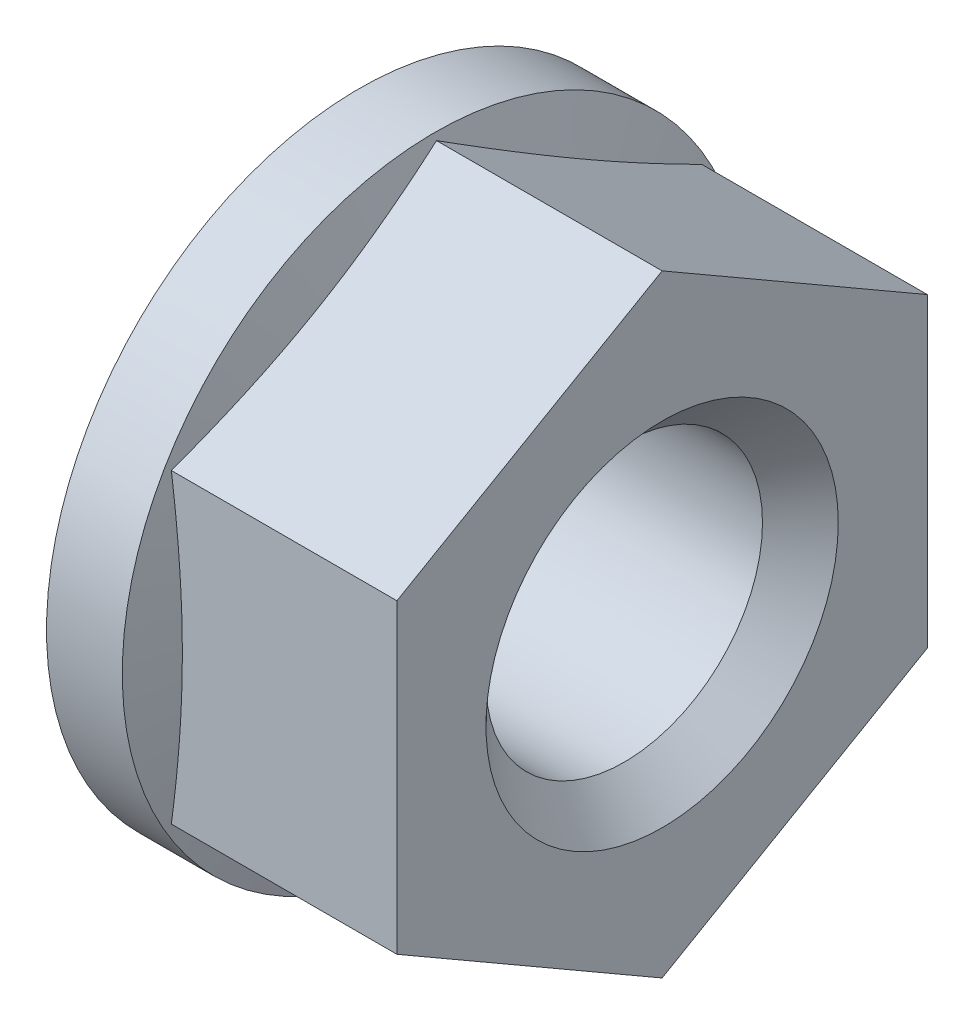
ISO-10303-21;
HEADER;
FILE_DESCRIPTION(('STEP AP214'),'2;1');
FILE_NAME('part.step','',(''),(''),'','','');
FILE_SCHEMA(('AUTOMOTIVE_DESIGN { 1 0 10303 214 1 1 1 1 }'));
ENDSEC;
DATA;
#1=APPLICATION_CONTEXT('core data for automotive mechanical design processes');
#2=APPLICATION_PROTOCOL_DEFINITION('international standard','automotive_design',2000,#1);
#3=PRODUCT_CONTEXT('',#1,'mechanical');
#4=PRODUCT('Part','Part','',(#3));
#5=PRODUCT_RELATED_PRODUCT_CATEGORY('part','',(#4));
#6=PRODUCT_DEFINITION_FORMATION('','',#4);
#7=PRODUCT_DEFINITION_CONTEXT('part definition',#1,'design');
#8=PRODUCT_DEFINITION('design','',#6,#7);
#9=PRODUCT_DEFINITION_SHAPE('','',#8);
#10=(LENGTH_UNIT() NAMED_UNIT(*) SI_UNIT(.MILLI.,.METRE.));
#11=(NAMED_UNIT(*) PLANE_ANGLE_UNIT() SI_UNIT($,.RADIAN.));
#12=(NAMED_UNIT(*) SI_UNIT($,.STERADIAN.) SOLID_ANGLE_UNIT());
#13=UNCERTAINTY_MEASURE_WITH_UNIT(LENGTH_MEASURE(1.E-05),#10,'distance_accuracy_value','');
#14=(GEOMETRIC_REPRESENTATION_CONTEXT(3) GLOBAL_UNCERTAINTY_ASSIGNED_CONTEXT((#13)) GLOBAL_UNIT_ASSIGNED_CONTEXT((#10,
#11,#12)) REPRESENTATION_CONTEXT('',''));
#15=CARTESIAN_POINT('',(0.,0.,0.));
#16=DIRECTION('',(0.,0.,1.));
#17=DIRECTION('',(1.,0.,0.));
#18=AXIS2_PLACEMENT_3D('',#15,#16,#17);
#19=CARTESIAN_POINT('',(0.,0.,0.));
#20=DIRECTION('',(1.,0.,0.));
#21=DIRECTION('',(0.,0.,-1.));
#22=AXIS2_PLACEMENT_3D('',#19,#20,#21);
#23=CYLINDRICAL_SURFACE('',#22,8.25);
#24=CARTESIAN_POINT('',(0.,0.,0.));
#25=DIRECTION('',(1.,0.,0.));
#26=DIRECTION('',(0.,0.,-1.));
#27=AXIS2_PLACEMENT_3D('',#24,#25,#26);
#28=CIRCLE('',#27,8.25);
#29=CARTESIAN_POINT('',(0.,0.,-8.25));
#30=VERTEX_POINT('',#29);
#31=EDGE_CURVE('E197',#30,#30,#28,.T.);
#32=ORIENTED_EDGE('',*,*,#31,.T.);
#33=EDGE_LOOP('',(#32));
#34=FACE_BOUND('',#33,.T.);
#35=CARTESIAN_POINT('',(2.,0.,0.));
#36=DIRECTION('',(1.,0.,0.));
#37=DIRECTION('',(0.,0.,-1.));
#38=AXIS2_PLACEMENT_3D('',#35,#36,#37);
#39=CIRCLE('',#38,8.25);
#40=CARTESIAN_POINT('',(2.,0.,-8.25));
#41=VERTEX_POINT('',#40);
#42=EDGE_CURVE('E194',#41,#41,#39,.T.);
#43=ORIENTED_EDGE('',*,*,#42,.F.);
#44=EDGE_LOOP('',(#43));
#45=FACE_BOUND('',#44,.T.);
#46=ADVANCED_FACE('F38',(#34,#45),#23,.T.);
#47=CARTESIAN_POINT('',(0.,8.25,0.));
#48=DIRECTION('',(-1.,0.,0.));
#49=DIRECTION('',(0.,0.,1.));
#50=AXIS2_PLACEMENT_3D('',#47,#48,#49);
#51=PLANE('',#50);
#52=CARTESIAN_POINT('',(0.,0.,0.));
#53=DIRECTION('',(-1.,0.,0.));
#54=DIRECTION('',(0.,0.,1.));
#55=AXIS2_PLACEMENT_3D('',#52,#53,#54);
#56=CIRCLE('',#55,3.64999999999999);
#57=CARTESIAN_POINT('',(0.,0.,3.64999999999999));
#58=VERTEX_POINT('',#57);
#59=EDGE_CURVE('E111',#58,#58,#56,.T.);
#60=ORIENTED_EDGE('',*,*,#59,.F.);
#61=EDGE_LOOP('',(#60));
#62=FACE_BOUND('',#61,.T.);
#63=ORIENTED_EDGE('',*,*,#31,.F.);
#64=EDGE_LOOP('',(#63));
#65=FACE_BOUND('',#64,.T.);
#66=ADVANCED_FACE('F213',(#62,#65),#51,.T.);
#67=CARTESIAN_POINT('',(4.21058083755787,0.,0.));
#68=DIRECTION('',(-1.,0.,0.));
#69=DIRECTION('',(0.,0.,1.));
#70=AXIS2_PLACEMENT_3D('',#67,#68,#69);
#71=CONICAL_SURFACE('',#70,0.,1.30899693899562);
#72=CARTESIAN_POINT('',(2.04477330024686,-4.04145188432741,7.00000000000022));
#73=CARTESIAN_POINT('',(2.08976059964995,-4.20928324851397,6.70930755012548));
#74=CARTESIAN_POINT('',(2.13060150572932,-4.37741889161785,6.41808807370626));
#75=CARTESIAN_POINT('',(2.20235498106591,-4.71428390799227,5.83462075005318));
#76=CARTESIAN_POINT('',(2.23326351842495,-4.883013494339,5.54237253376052));
#77=CARTESIAN_POINT('',(2.28334798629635,-5.22004348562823,4.95861946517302));
#78=CARTESIAN_POINT('',(2.30258363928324,-5.38834161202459,4.66711855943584));
#79=CARTESIAN_POINT('',(2.32837666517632,-5.72515246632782,4.08374504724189));
#80=CARTESIAN_POINT('',(2.33493649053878,-5.8936651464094,3.79187252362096));
#81=CARTESIAN_POINT('',(2.33493649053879,-6.23069050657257,3.20812747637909));
#82=CARTESIAN_POINT('',(2.32837666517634,-6.39920318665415,2.91625495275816));
#83=CARTESIAN_POINT('',(2.30258363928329,-6.73601404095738,2.33288144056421));
#84=CARTESIAN_POINT('',(2.2833479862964,-6.90431216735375,2.04138053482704));
#85=CARTESIAN_POINT('',(2.23326351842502,-7.24134215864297,1.45762746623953));
#86=CARTESIAN_POINT('',(2.20235498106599,-7.41007174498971,1.16537924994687));
#87=CARTESIAN_POINT('',(2.13060150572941,-7.74693676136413,0.581911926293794));
#88=CARTESIAN_POINT('',(2.08976059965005,-7.91507240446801,0.290692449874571));
#89=CARTESIAN_POINT('',(2.04477330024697,-8.08290376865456,-1.70279131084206E-13));
#90=B_SPLINE_CURVE_WITH_KNOTS('',3,(#72,#73,#74,#75,#76,#77,#78,#79,#80,#81,#82,#83,#84,#85,#86,
#87,#88,#89),.UNSPECIFIED.,.F.,.F.,(4,2,2,2,2,2,2,2,4),(0.,1.01604530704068,2.03250254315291,
3.04371439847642,4.05473058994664,5.06574678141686,6.07695863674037,7.0934158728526,
8.10946117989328),.UNSPECIFIED.);
#91=CARTESIAN_POINT('',(2.04477330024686,-4.04145188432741,7.00000000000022));
#92=VERTEX_POINT('',#91);
#93=CARTESIAN_POINT('',(2.04477330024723,-8.08290376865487,0.));
#94=VERTEX_POINT('',#93);
#95=EDGE_CURVE('E118',#92,#94,#90,.T.);
#96=ORIENTED_EDGE('',*,*,#95,.F.);
#97=CARTESIAN_POINT('',(2.04477330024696,4.04145188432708,7.));
#98=CARTESIAN_POINT('',(2.08976059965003,3.70578915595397,7.));
#99=CARTESIAN_POINT('',(2.13060150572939,3.36951786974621,7.));
#100=CARTESIAN_POINT('',(2.20235498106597,2.69578783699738,7.));
#101=CARTESIAN_POINT('',(2.23326351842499,2.35832866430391,7.));
#102=CARTESIAN_POINT('',(2.28334798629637,1.68426868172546,7.));
#103=CARTESIAN_POINT('',(2.30258363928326,1.34767242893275,7.));
#104=CARTESIAN_POINT('',(2.32837666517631,0.674050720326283,7.));
#105=CARTESIAN_POINT('',(2.33493649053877,0.337025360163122,7.));
#106=CARTESIAN_POINT('',(2.33493649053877,-0.337025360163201,7.));
#107=CARTESIAN_POINT('',(2.32837666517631,-0.674050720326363,7.));
#108=CARTESIAN_POINT('',(2.30258363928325,-1.34767242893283,7.));
#109=CARTESIAN_POINT('',(2.28334798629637,-1.68426868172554,7.));
#110=CARTESIAN_POINT('',(2.23326351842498,-2.35832866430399,7.));
#111=CARTESIAN_POINT('',(2.20235498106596,-2.69578783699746,7.));
#112=CARTESIAN_POINT('',(2.13060150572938,-3.36951786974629,7.));
#113=CARTESIAN_POINT('',(2.08976059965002,-3.70578915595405,7.));
#114=CARTESIAN_POINT('',(2.04477330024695,-4.04145188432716,7.));
#115=B_SPLINE_CURVE_WITH_KNOTS('',3,(#97,#98,#99,#100,#101,#102,#103,#104,#105,#106,#107,#108,
#109,#110,#111,#112,#113,#114),.UNSPECIFIED.,.F.,.F.,(4,2,2,2,2,2,2,2,4),(0.,1.01604530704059,
2.03250254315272,3.04371439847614,4.05473058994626,5.06574678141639,6.07695863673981,
7.09341587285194,8.10946117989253),.UNSPECIFIED.);
#116=CARTESIAN_POINT('',(2.04477330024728,4.04145188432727,7.));
#117=VERTEX_POINT('',#116);
#118=EDGE_CURVE('E100',#117,#92,#115,.T.);
#119=ORIENTED_EDGE('',*,*,#118,.F.);
#120=CARTESIAN_POINT('',(2.04477330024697,8.08290376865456,-1.70669287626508E-13));
#121=CARTESIAN_POINT('',(2.08976059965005,7.91507240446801,0.290692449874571));
#122=CARTESIAN_POINT('',(2.13060150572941,7.74693676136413,0.581911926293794));
#123=CARTESIAN_POINT('',(2.20235498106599,7.41007174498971,1.16537924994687));
#124=CARTESIAN_POINT('',(2.23326351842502,7.24134215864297,1.45762746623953));
#125=CARTESIAN_POINT('',(2.2833479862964,6.90431216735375,2.04138053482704));
#126=CARTESIAN_POINT('',(2.30258363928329,6.73601404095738,2.33288144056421));
#127=CARTESIAN_POINT('',(2.32837666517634,6.39920318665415,2.91625495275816));
#128=CARTESIAN_POINT('',(2.33493649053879,6.23069050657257,3.20812747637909));
#129=CARTESIAN_POINT('',(2.33493649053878,5.8936651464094,3.79187252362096));
#130=CARTESIAN_POINT('',(2.32837666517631,5.72515246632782,4.08374504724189));
#131=CARTESIAN_POINT('',(2.30258363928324,5.38834161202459,4.66711855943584));
#132=CARTESIAN_POINT('',(2.28334798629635,5.22004348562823,4.95861946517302));
#133=CARTESIAN_POINT('',(2.23326351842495,4.883013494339,5.54237253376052));
#134=CARTESIAN_POINT('',(2.20235498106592,4.71428390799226,5.83462075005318));
#135=CARTESIAN_POINT('',(2.13060150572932,4.37741889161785,6.41808807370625));
#136=CARTESIAN_POINT('',(2.08976059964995,4.20928324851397,6.70930755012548));
#137=CARTESIAN_POINT('',(2.04477330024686,4.04145188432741,7.00000000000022));
#138=B_SPLINE_CURVE_WITH_KNOTS('',3,(#120,#121,#122,#123,#124,#125,#126,#127,#128,#129,#130,
#131,#132,#133,#134,#135,#136,#137),.UNSPECIFIED.,.F.,.F.,(4,2,2,2,2,2,2,2,4),(0.,
1.01604530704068,2.03250254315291,3.04371439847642,4.05473058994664,5.06574678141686,
6.07695863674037,7.0934158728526,8.10946117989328),.UNSPECIFIED.);
#139=CARTESIAN_POINT('',(2.04477330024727,8.08290376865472,0.));
#140=VERTEX_POINT('',#139);
#141=EDGE_CURVE('E97',#140,#117,#138,.T.);
#142=ORIENTED_EDGE('',*,*,#141,.F.);
#143=CARTESIAN_POINT('',(2.04477330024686,4.04145188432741,-7.00000000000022));
#144=CARTESIAN_POINT('',(2.08976059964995,4.20928324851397,-6.70930755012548));
#145=CARTESIAN_POINT('',(2.13060150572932,4.37741889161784,-6.41808807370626));
#146=CARTESIAN_POINT('',(2.20235498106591,4.71428390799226,-5.83462075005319));
#147=CARTESIAN_POINT('',(2.23326351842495,4.88301349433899,-5.54237253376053));
#148=CARTESIAN_POINT('',(2.28334798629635,5.22004348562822,-4.95861946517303));
#149=CARTESIAN_POINT('',(2.30258363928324,5.38834161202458,-4.66711855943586));
#150=CARTESIAN_POINT('',(2.32837666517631,5.72515246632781,-4.08374504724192));
#151=CARTESIAN_POINT('',(2.33493649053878,5.89366514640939,-3.79187252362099));
#152=CARTESIAN_POINT('',(2.33493649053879,6.23069050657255,-3.20812747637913));
#153=CARTESIAN_POINT('',(2.32837666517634,6.39920318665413,-2.91625495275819));
#154=CARTESIAN_POINT('',(2.30258363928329,6.73601404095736,-2.33288144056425));
#155=CARTESIAN_POINT('',(2.2833479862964,6.90431216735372,-2.04138053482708));
#156=CARTESIAN_POINT('',(2.23326351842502,7.24134215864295,-1.45762746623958));
#157=CARTESIAN_POINT('',(2.202354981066,7.41007174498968,-1.16537924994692));
#158=CARTESIAN_POINT('',(2.13060150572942,7.7469367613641,-0.581911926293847));
#159=CARTESIAN_POINT('',(2.08976059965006,7.91507240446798,-0.290692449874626));
#160=CARTESIAN_POINT('',(2.04477330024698,8.08290376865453,1.13101905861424E-13));
#161=B_SPLINE_CURVE_WITH_KNOTS('',3,(#143,#144,#145,#146,#147,#148,#149,#150,#151,#152,#153,
#154,#155,#156,#157,#158,#159,#160),.UNSPECIFIED.,.F.,.F.,(4,2,2,2,2,2,2,2,4),(0.,
1.01604530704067,2.03250254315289,3.0437143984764,4.0547305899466,5.06574678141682,
6.07695863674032,7.09341587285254,8.10946117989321),.UNSPECIFIED.);
#162=CARTESIAN_POINT('',(2.04477330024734,4.04145188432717,-6.99999999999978));
#163=VERTEX_POINT('',#162);
#164=EDGE_CURVE('E166',#163,#140,#161,.T.);
#165=ORIENTED_EDGE('',*,*,#164,.F.);
#166=CARTESIAN_POINT('',(2.04477330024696,-4.04145188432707,-7.));
#167=CARTESIAN_POINT('',(2.08976059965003,-3.70578915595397,-7.));
#168=CARTESIAN_POINT('',(2.13060150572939,-3.36951786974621,-7.));
#169=CARTESIAN_POINT('',(2.20235498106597,-2.69578783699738,-7.));
#170=CARTESIAN_POINT('',(2.23326351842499,-2.35832866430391,-7.));
#171=CARTESIAN_POINT('',(2.28334798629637,-1.68426868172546,-7.));
#172=CARTESIAN_POINT('',(2.30258363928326,-1.34767242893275,-7.));
#173=CARTESIAN_POINT('',(2.32837666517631,-0.674050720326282,-7.));
#174=CARTESIAN_POINT('',(2.33493649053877,-0.337025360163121,-7.));
#175=CARTESIAN_POINT('',(2.33493649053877,0.337025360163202,-7.));
#176=CARTESIAN_POINT('',(2.32837666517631,0.674050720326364,-7.));
#177=CARTESIAN_POINT('',(2.30258363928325,1.34767242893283,-7.));
#178=CARTESIAN_POINT('',(2.28334798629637,1.68426868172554,-7.));
#179=CARTESIAN_POINT('',(2.23326351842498,2.35832866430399,-7.));
#180=CARTESIAN_POINT('',(2.20235498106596,2.69578783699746,-7.));
#181=CARTESIAN_POINT('',(2.13060150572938,3.36951786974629,-7.));
#182=CARTESIAN_POINT('',(2.08976059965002,3.70578915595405,-7.));
#183=CARTESIAN_POINT('',(2.04477330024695,4.04145188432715,-7.));
#184=B_SPLINE_CURVE_WITH_KNOTS('',3,(#166,#167,#168,#169,#170,#171,#172,#173,#174,#175,#176,
#177,#178,#179,#180,#181,#182,#183),.UNSPECIFIED.,.F.,.F.,(4,2,2,2,2,2,2,2,4),(0.,
1.01604530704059,2.03250254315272,3.04371439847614,4.05473058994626,5.06574678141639,
6.07695863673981,7.09341587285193,8.10946117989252),.UNSPECIFIED.);
#185=CARTESIAN_POINT('',(2.04477330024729,-4.04145188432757,-6.99999999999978));
#186=VERTEX_POINT('',#185);
#187=EDGE_CURVE('E58',#186,#163,#184,.T.);
#188=ORIENTED_EDGE('',*,*,#187,.F.);
#189=CARTESIAN_POINT('',(2.04477330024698,-8.08290376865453,1.13636466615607E-13));
#190=CARTESIAN_POINT('',(2.08976059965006,-7.91507240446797,-0.290692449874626));
#191=CARTESIAN_POINT('',(2.13060150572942,-7.7469367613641,-0.581911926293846));
#192=CARTESIAN_POINT('',(2.202354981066,-7.41007174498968,-1.16537924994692));
#193=CARTESIAN_POINT('',(2.23326351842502,-7.24134215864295,-1.45762746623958));
#194=CARTESIAN_POINT('',(2.2833479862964,-6.90431216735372,-2.04138053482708));
#195=CARTESIAN_POINT('',(2.30258363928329,-6.73601404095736,-2.33288144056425));
#196=CARTESIAN_POINT('',(2.32837666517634,-6.39920318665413,-2.91625495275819));
#197=CARTESIAN_POINT('',(2.33493649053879,-6.23069050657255,-3.20812747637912));
#198=CARTESIAN_POINT('',(2.33493649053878,-5.89366514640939,-3.79187252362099));
#199=CARTESIAN_POINT('',(2.32837666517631,-5.72515246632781,-4.08374504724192));
#200=CARTESIAN_POINT('',(2.30258363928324,-5.38834161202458,-4.66711855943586));
#201=CARTESIAN_POINT('',(2.28334798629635,-5.22004348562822,-4.95861946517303));
#202=CARTESIAN_POINT('',(2.23326351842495,-4.88301349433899,-5.54237253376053));
#203=CARTESIAN_POINT('',(2.20235498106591,-4.71428390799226,-5.83462075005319));
#204=CARTESIAN_POINT('',(2.13060150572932,-4.37741889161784,-6.41808807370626));
#205=CARTESIAN_POINT('',(2.08976059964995,-4.20928324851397,-6.70930755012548));
#206=CARTESIAN_POINT('',(2.04477330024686,-4.04145188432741,-7.00000000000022));
#207=B_SPLINE_CURVE_WITH_KNOTS('',3,(#189,#190,#191,#192,#193,#194,#195,#196,#197,#198,#199,
#200,#201,#202,#203,#204,#205,#206),.UNSPECIFIED.,.F.,.F.,(4,2,2,2,2,2,2,2,4),(0.,
1.01604530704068,2.03250254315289,3.0437143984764,4.05473058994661,5.06574678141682,
6.07695863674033,7.09341587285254,8.10946117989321),.UNSPECIFIED.);
#208=EDGE_CURVE('E53',#94,#186,#207,.T.);
#209=ORIENTED_EDGE('',*,*,#208,.F.);
#210=EDGE_LOOP('',(#96,#119,#142,#165,#188,#209));
#211=FACE_BOUND('',#210,.T.);
#212=ORIENTED_EDGE('',*,*,#42,.T.);
#213=EDGE_LOOP('',(#212));
#214=FACE_BOUND('',#213,.T.);
#215=ADVANCED_FACE('F218',(#211,#214),#71,.T.);
#216=CARTESIAN_POINT('',(8.,-4.04145188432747,7.00000000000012));
#217=DIRECTION('',(1.,0.,0.));
#218=DIRECTION('',(0.,0.,-1.));
#219=AXIS2_PLACEMENT_3D('',#216,#217,#218);
#220=PLANE('',#219);
#221=CARTESIAN_POINT('',(8.,0.,0.));
#222=DIRECTION('',(1.,0.,0.));
#223=DIRECTION('',(0.,0.,-1.));
#224=AXIS2_PLACEMENT_3D('',#221,#222,#223);
#225=CIRCLE('',#224,4.64999999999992);
#226=CARTESIAN_POINT('',(8.,0.,-4.64999999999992));
#227=VERTEX_POINT('',#226);
#228=EDGE_CURVE('E11',#227,#227,#225,.F.);
#229=ORIENTED_EDGE('',*,*,#228,.T.);
#230=EDGE_LOOP('',(#229));
#231=FACE_BOUND('',#230,.T.);
#232=DIRECTION('',(0.,-1.,0.));
#233=VECTOR('',#232,1.);
#234=CARTESIAN_POINT('',(8.,4.04145188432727,7.));
#235=LINE('',#234,#233);
#236=CARTESIAN_POINT('',(8.,4.04145188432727,7.));
#237=VERTEX_POINT('',#236);
#238=CARTESIAN_POINT('',(8.,-4.04145188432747,7.00000000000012));
#239=VERTEX_POINT('',#238);
#240=EDGE_CURVE('E103',#237,#239,#235,.T.);
#241=ORIENTED_EDGE('',*,*,#240,.T.);
#242=DIRECTION('',(0.,-0.5,-0.866025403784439));
#243=VECTOR('',#242,1.);
#244=CARTESIAN_POINT('',(8.,-4.04145188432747,7.00000000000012));
#245=LINE('',#244,#243);
#246=CARTESIAN_POINT('',(8.,-8.08290376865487,0.));
#247=VERTEX_POINT('',#246);
#248=EDGE_CURVE('E110',#239,#247,#245,.T.);
#249=ORIENTED_EDGE('',*,*,#248,.T.);
#250=DIRECTION('',(0.,0.5,-0.866025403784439));
#251=VECTOR('',#250,1.);
#252=CARTESIAN_POINT('',(8.,-8.08290376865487,0.));
#253=LINE('',#252,#251);
#254=CARTESIAN_POINT('',(8.,-4.04145188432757,-6.99999999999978));
#255=VERTEX_POINT('',#254);
#256=EDGE_CURVE('E129',#247,#255,#253,.T.);
#257=ORIENTED_EDGE('',*,*,#256,.T.);
#258=DIRECTION('',(0.,1.,0.));
#259=VECTOR('',#258,1.);
#260=CARTESIAN_POINT('',(8.,-4.04145188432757,-6.99999999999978));
#261=LINE('',#260,#259);
#262=CARTESIAN_POINT('',(8.,4.04145188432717,-6.99999999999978));
#263=VERTEX_POINT('',#262);
#264=EDGE_CURVE('E124',#255,#263,#261,.T.);
#265=ORIENTED_EDGE('',*,*,#264,.T.);
#266=DIRECTION('',(0.,0.500000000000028,0.866025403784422));
#267=VECTOR('',#266,1.);
#268=CARTESIAN_POINT('',(8.,4.04145188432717,-6.99999999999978));
#269=LINE('',#268,#267);
#270=CARTESIAN_POINT('',(8.,8.08290376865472,0.));
#271=VERTEX_POINT('',#270);
#272=EDGE_CURVE('E117',#263,#271,#269,.T.);
#273=ORIENTED_EDGE('',*,*,#272,.T.);
#274=DIRECTION('',(0.,-0.500000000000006,0.866025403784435));
#275=VECTOR('',#274,1.);
#276=CARTESIAN_POINT('',(8.,8.08290376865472,0.));
#277=LINE('',#276,#275);
#278=EDGE_CURVE('E96',#271,#237,#277,.T.);
#279=ORIENTED_EDGE('',*,*,#278,.T.);
#280=EDGE_LOOP('',(#241,#249,#257,#265,#273,#279));
#281=FACE_BOUND('',#280,.T.);
#282=ADVANCED_FACE('F114',(#231,#281),#220,.T.);
#283=CARTESIAN_POINT('',(-0.000999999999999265,-4.04145188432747,7.00000000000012));
#284=DIRECTION('',(0.,-0.866025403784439,0.5));
#285=DIRECTION('',(0.,-0.5,-0.866025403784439));
#286=AXIS2_PLACEMENT_3D('',#283,#284,#285);
#287=PLANE('',#286);
#288=DIRECTION('',(1.,0.,0.));
#289=VECTOR('',#288,1.);
#290=CARTESIAN_POINT('',(-0.000999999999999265,-4.04145188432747,7.00000000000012));
#291=LINE('',#290,#289);
#292=EDGE_CURVE('E106',#92,#239,#291,.T.);
#293=ORIENTED_EDGE('',*,*,#292,.F.);
#294=ORIENTED_EDGE('',*,*,#95,.T.);
#295=DIRECTION('',(1.,0.,0.));
#296=VECTOR('',#295,1.);
#297=CARTESIAN_POINT('',(-0.000999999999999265,-8.08290376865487,0.));
#298=LINE('',#297,#296);
#299=EDGE_CURVE('E122',#94,#247,#298,.T.);
#300=ORIENTED_EDGE('',*,*,#299,.T.);
#301=ORIENTED_EDGE('',*,*,#248,.F.);
#302=EDGE_LOOP('',(#293,#294,#300,#301));
#303=FACE_BOUND('',#302,.T.);
#304=ADVANCED_FACE('F225',(#303),#287,.T.);
#305=CARTESIAN_POINT('',(-0.000999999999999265,-8.08290376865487,0.));
#306=DIRECTION('',(0.,-0.866025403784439,-0.5));
#307=DIRECTION('',(0.,0.5,-0.866025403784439));
#308=AXIS2_PLACEMENT_3D('',#305,#306,#307);
#309=PLANE('',#308);
#310=ORIENTED_EDGE('',*,*,#299,.F.);
#311=ORIENTED_EDGE('',*,*,#208,.T.);
#312=DIRECTION('',(1.,0.,0.));
#313=VECTOR('',#312,1.);
#314=CARTESIAN_POINT('',(-0.000999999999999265,-4.04145188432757,-6.99999999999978));
#315=LINE('',#314,#313);
#316=EDGE_CURVE('E176',#186,#255,#315,.T.);
#317=ORIENTED_EDGE('',*,*,#316,.T.);
#318=ORIENTED_EDGE('',*,*,#256,.F.);
#319=EDGE_LOOP('',(#310,#311,#317,#318));
#320=FACE_BOUND('',#319,.T.);
#321=ADVANCED_FACE('F228',(#320),#309,.T.);
#322=CARTESIAN_POINT('',(-0.000999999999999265,-4.04145188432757,-6.99999999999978));
#323=DIRECTION('',(0.,0.,-1.));
#324=DIRECTION('',(-1.,0.,0.));
#325=AXIS2_PLACEMENT_3D('',#322,#323,#324);
#326=PLANE('',#325);
#327=ORIENTED_EDGE('',*,*,#316,.F.);
#328=ORIENTED_EDGE('',*,*,#187,.T.);
#329=DIRECTION('',(1.,0.,0.));
#330=VECTOR('',#329,1.);
#331=CARTESIAN_POINT('',(-0.000999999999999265,4.04145188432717,-6.99999999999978));
#332=LINE('',#331,#330);
#333=EDGE_CURVE('E175',#163,#263,#332,.T.);
#334=ORIENTED_EDGE('',*,*,#333,.T.);
#335=ORIENTED_EDGE('',*,*,#264,.F.);
#336=EDGE_LOOP('',(#327,#328,#334,#335));
#337=FACE_BOUND('',#336,.T.);
#338=ADVANCED_FACE('F232',(#337),#326,.T.);
#339=CARTESIAN_POINT('',(-0.000999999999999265,4.04145188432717,-6.99999999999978));
#340=DIRECTION('',(0.,0.866025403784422,-0.500000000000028));
#341=DIRECTION('',(0.,0.500000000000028,0.866025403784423));
#342=AXIS2_PLACEMENT_3D('',#339,#340,#341);
#343=PLANE('',#342);
#344=ORIENTED_EDGE('',*,*,#333,.F.);
#345=ORIENTED_EDGE('',*,*,#164,.T.);
#346=DIRECTION('',(1.,0.,0.));
#347=VECTOR('',#346,1.);
#348=CARTESIAN_POINT('',(-0.000999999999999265,8.08290376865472,0.));
#349=LINE('',#348,#347);
#350=EDGE_CURVE('E321',#140,#271,#349,.T.);
#351=ORIENTED_EDGE('',*,*,#350,.T.);
#352=ORIENTED_EDGE('',*,*,#272,.F.);
#353=EDGE_LOOP('',(#344,#345,#351,#352));
#354=FACE_BOUND('',#353,.T.);
#355=ADVANCED_FACE('F235',(#354),#343,.T.);
#356=CARTESIAN_POINT('',(-0.000999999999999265,8.08290376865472,0.));
#357=DIRECTION('',(0.,0.866025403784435,0.500000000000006));
#358=DIRECTION('',(0.,-0.500000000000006,0.866025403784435));
#359=AXIS2_PLACEMENT_3D('',#356,#357,#358);
#360=PLANE('',#359);
#361=ORIENTED_EDGE('',*,*,#350,.F.);
#362=ORIENTED_EDGE('',*,*,#141,.T.);
#363=DIRECTION('',(1.,0.,0.));
#364=VECTOR('',#363,1.);
#365=CARTESIAN_POINT('',(-0.000999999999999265,4.04145188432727,7.));
#366=LINE('',#365,#364);
#367=EDGE_CURVE('E91',#117,#237,#366,.T.);
#368=ORIENTED_EDGE('',*,*,#367,.T.);
#369=ORIENTED_EDGE('',*,*,#278,.F.);
#370=EDGE_LOOP('',(#361,#362,#368,#369));
#371=FACE_BOUND('',#370,.T.);
#372=ADVANCED_FACE('F94',(#371),#360,.T.);
#373=CARTESIAN_POINT('',(-0.000999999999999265,4.04145188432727,7.));
#374=DIRECTION('',(0.,0.,1.));
#375=DIRECTION('',(0.,-1.,0.));
#376=AXIS2_PLACEMENT_3D('',#373,#374,#375);
#377=PLANE('',#376);
#378=ORIENTED_EDGE('',*,*,#367,.F.);
#379=ORIENTED_EDGE('',*,*,#118,.T.);
#380=ORIENTED_EDGE('',*,*,#292,.T.);
#381=ORIENTED_EDGE('',*,*,#240,.F.);
#382=EDGE_LOOP('',(#378,#379,#380,#381));
#383=FACE_BOUND('',#382,.T.);
#384=ADVANCED_FACE('F104',(#383),#377,.T.);
#385=CARTESIAN_POINT('',(8.,0.,0.));
#386=DIRECTION('',(1.,0.,0.));
#387=DIRECTION('',(0.,0.,-1.));
#388=AXIS2_PLACEMENT_3D('',#385,#386,#387);
#389=CYLINDRICAL_SURFACE('',#388,3.64999999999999);
#390=CARTESIAN_POINT('',(7.00000000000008,0.,0.));
#391=DIRECTION('',(1.,0.,0.));
#392=DIRECTION('',(0.,0.,-1.));
#393=AXIS2_PLACEMENT_3D('',#390,#391,#392);
#394=CIRCLE('',#393,3.64999999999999);
#395=CARTESIAN_POINT('',(7.00000000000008,0.,-3.64999999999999));
#396=VERTEX_POINT('',#395);
#397=EDGE_CURVE('E46',#396,#396,#394,.T.);
#398=ORIENTED_EDGE('',*,*,#397,.T.);
#399=EDGE_LOOP('',(#398));
#400=FACE_BOUND('',#399,.T.);
#401=ORIENTED_EDGE('',*,*,#59,.T.);
#402=EDGE_LOOP('',(#401));
#403=FACE_BOUND('',#402,.T.);
#404=ADVANCED_FACE('F202',(#400,#403),#389,.F.);
#405=CARTESIAN_POINT('',(7.00000000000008,0.,0.));
#406=DIRECTION('',(1.,0.,0.));
#407=DIRECTION('',(0.,0.,-1.));
#408=AXIS2_PLACEMENT_3D('',#405,#406,#407);
#409=CONICAL_SURFACE('',#408,3.64999999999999,0.785398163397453);
#410=ORIENTED_EDGE('',*,*,#228,.F.);
#411=EDGE_LOOP('',(#410));
#412=FACE_BOUND('',#411,.T.);
#413=ORIENTED_EDGE('',*,*,#397,.F.);
#414=EDGE_LOOP('',(#413));
#415=FACE_BOUND('',#414,.T.);
#416=ADVANCED_FACE('F40',(#412,#415),#409,.F.);
#417=CLOSED_SHELL('',(#46,#66,#215,#282,#304,#321,#338,#355,#372,#384,#404,#416));
#418=MANIFOLD_SOLID_BREP('B2',#417);
#419=ADVANCED_BREP_SHAPE_REPRESENTATION('',(#18,#418),#14);
#420=SHAPE_DEFINITION_REPRESENTATION(#9,#419);
ENDSEC;
END-ISO-10303-21;
